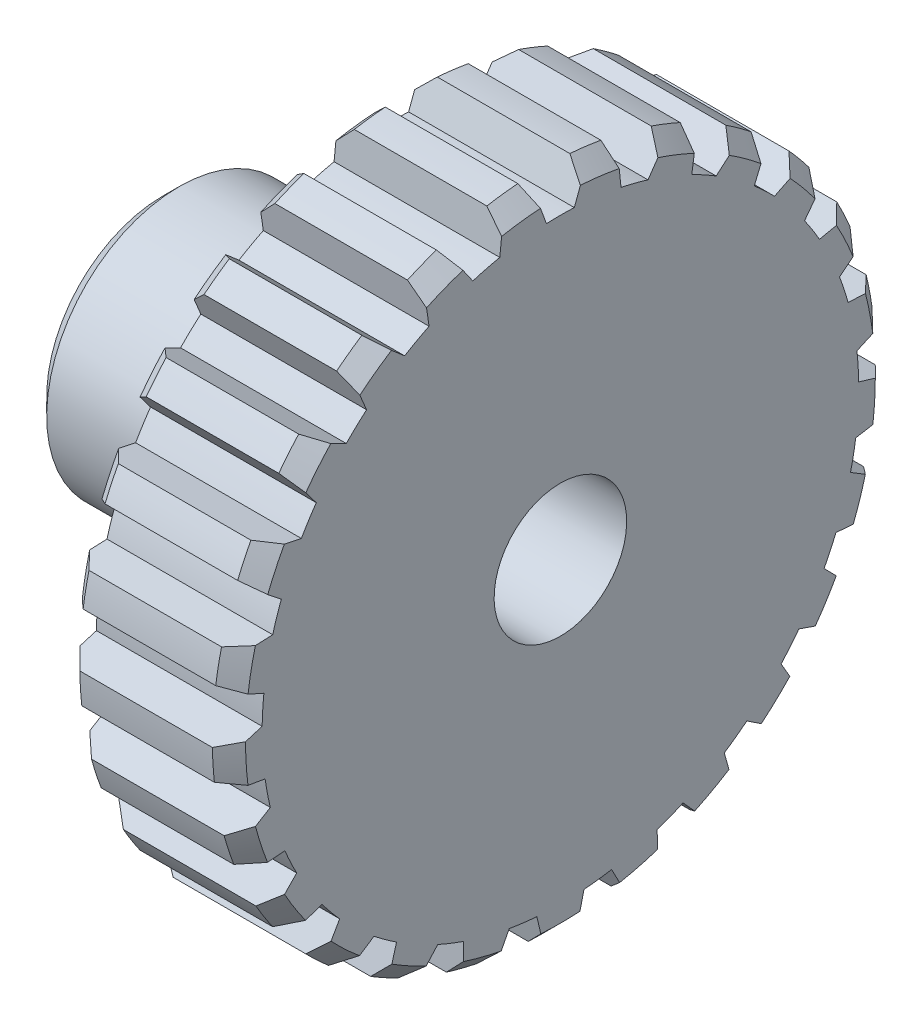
from build123d import *

# Parameters (mm, degrees)
CHAMFER4_SIZE      = 0.5
CUT_EXTRUDE2_DEPTH = 10


with BuildPart() as part:
    # Sketch1 → Revolve1 (revolve)
    with BuildSketch(Plane.XY):
        Polygon((0, 2), (-12, 2), (-12, 4), (-5, 4), (-5, 10), (0, 10), align=None)
    revolve(axis=Axis((0, 0, 0), (-1, 0, 0)))

    # Chamfer4
    chamfer4_edges = [part.edges().sort_by_distance(p)[0] for p in [
        (-12, -4, 0),
        (-5, -10, 0),
        (0, -10, 0),
    ]]
    chamfer(chamfer4_edges, length=CHAMFER4_SIZE)

    # Sketch3 → Cut-Extrude2 (cut)
    with BuildSketch(Plane(origin=(0, 0, 0), x_dir=(0, 0, -1), z_dir=(1, 0, 0))):
        with BuildLine():
            Line((-0.785, 9.969141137), (-0.42, 8.990194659))
            ThreePointArc((-0.42, 8.990194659), (0, 9), (0.42, 8.990194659))
            Line((0.42, 8.990194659), (0.785, 9.969141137))
            Line((0.785, 9.969141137), (0.785, 10.77942288))
            ThreePointArc((0.785, 10.77942288), (0, 10.807968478), (-0.785, 10.77942288))
            Line((-0.785, 10.77942288), (-0.785, 9.969141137))
        make_face()
        with BuildLine():
            Line((1.920395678, 10.63598905), (1.718886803, 9.851163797))
            Line((1.718886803, 9.851163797), (1.828965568, 8.812200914))
            ThreePointArc((1.828965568, 8.812200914), (2.238208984, 8.71724845), (2.642575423, 8.603301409))
            Line((2.642575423, 8.603301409), (3.239562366, 9.460720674))
            Line((3.239562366, 9.460720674), (3.441071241, 10.245545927))
            ThreePointArc((3.441071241, 10.245545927), (2.687832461, 10.468416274), (1.920395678, 10.63598905))
        make_face()
        with BuildLine():
            Line((4.505125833, 9.824256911), (4.114769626, 9.114201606))
            Line((4.114769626, 9.114201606), (3.963010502, 8.080504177))
            ThreePointArc((3.963010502, 8.080504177), (4.335783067, 7.88676012), (4.699108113, 7.675831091))
            Line((4.699108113, 7.675831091), (5.490571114, 8.357848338))
            Line((5.490571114, 8.357848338), (5.880927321, 9.067903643))
            ThreePointArc((5.880927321, 9.067903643), (5.206778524, 9.471094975), (4.505125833, 9.824256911))
        make_face()
        with BuildLine():
            Line((6.806782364, 8.39523058), (6.252106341, 7.804560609))
            Line((6.252106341, 7.804560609), (5.848044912, 6.841079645))
            ThreePointArc((5.848044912, 6.841079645), (6.160923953, 6.560717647), (6.460378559, 6.266060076))
            Line((6.460378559, 6.266060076), (7.396587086, 6.729821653))
            Line((7.396587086, 6.729821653), (7.951263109, 7.320491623))
            ThreePointArc((7.951263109, 7.320491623), (7.398563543, 7.878669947), (6.806782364, 8.39523058))
        make_face()
        with BuildLine():
            Line((8.680743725, 6.438701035), (7.996600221, 6.004530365))
            Line((7.996600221, 6.004530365), (7.365625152, 5.171804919))
            ThreePointArc((7.365625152, 5.171804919), (7.59895133, 4.822441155), (7.81571966, 4.462569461))
            Line((7.81571966, 4.462569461), (8.837848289, 4.678935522))
            Line((8.837848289, 4.678935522), (9.521991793, 5.113106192))
            ThreePointArc((9.521991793, 5.113106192), (9.125469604, 5.79119911), (8.680743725, 6.438701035))
        make_face()
        with BuildLine():
            Line((10.009262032, 4.077604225), (9.238638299, 3.827213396))
            Line((9.238638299, 3.827213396), (8.420396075, 3.177566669))
            ThreePointArc((8.420396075, 3.177566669), (8.559508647, 2.781152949), (8.67997035, 2.378679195))
            Line((8.67997035, 2.378679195), (9.72379498, 2.334054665))
            Line((9.72379498, 2.334054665), (10.494418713, 2.584445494))
            ThreePointArc((10.494418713, 2.584445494), (10.278988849, 3.339845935), (10.009262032, 4.077604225))
        make_face()
        with BuildLine():
            Line((10.708861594, 1.460296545), (9.900178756, 1.409418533))
            Line((9.900178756, 1.409418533), (8.946082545, 0.983670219))
            ThreePointArc((8.946082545, 0.983670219), (8.982240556, 0.565114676), (8.998826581, 0.145327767))
            Line((8.998826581, 0.145327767), (9.998759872, -0.157483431))
            Line((9.998759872, -0.157483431), (10.807442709, -0.106605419))
            ThreePointArc((10.807442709, -0.106605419), (10.786641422, 0.678637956), (10.708861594, 1.460296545))
        make_face()
        with BuildLine():
            Line((10.735583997, -1.248766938), (9.939654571, -1.09693528))
            Line((9.939654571, -1.09693528), (8.909653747, -1.272033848))
            ThreePointArc((8.909653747, -1.272033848), (8.840585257, -1.686431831), (8.752253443, -2.097155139))
            Line((8.752253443, -2.097155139), (9.645465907, -2.639126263))
            Line((9.645465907, -2.639126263), (10.441395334, -2.790957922))
            ThreePointArc((10.441395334, -2.790957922), (10.616529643, -2.025211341), (10.735583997, -1.248766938))
        make_face()
        with BuildLine():
            Line((10.087750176, -3.879365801), (9.354585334, -3.534364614))
            Line((9.354585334, -3.534364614), (8.313398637, -3.447811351))
            ThreePointArc((8.313398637, -3.447811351), (8.143443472, -3.832013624), (7.955744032, -4.207866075))
            Line((7.955744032, -4.207866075), (8.686111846, -4.954943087))
            Line((8.686111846, -4.954943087), (9.419276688, -5.299944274))
            ThreePointArc((9.419276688, -5.299944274), (9.779342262, -4.601809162), (10.087750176, -3.879365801))
        make_face()
        with BuildLine():
            Line((8.806065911, -6.266209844), (8.181733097, -5.749716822))
            Line((8.181733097, -5.749716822), (7.194782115, -5.406950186))
            ThreePointArc((7.194782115, -5.406950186), (6.934619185, -5.736815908), (6.659345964, -6.05418131))
            Line((6.659345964, -6.05418131), (7.180977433, -6.959422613))
            Line((7.180977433, -6.959422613), (7.805310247, -7.475915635))
            ThreePointArc((7.805310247, -7.475915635), (8.32768284, -6.889258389), (8.806065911, -6.266209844))
        make_face()
        with BuildLine():
            Line((6.971064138, -8.259324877), (6.494792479, -7.603793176))
            Line((6.494792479, -7.603793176), (5.624090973, -7.026350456))
            ThreePointArc((5.624090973, -7.026350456), (5.290067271, -7.281152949), (4.944516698, -7.520090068))
            Line((4.944516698, -7.520090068), (5.224635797, -8.526616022))
            Line((5.224635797, -8.526616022), (5.700907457, -9.182147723))
            ThreePointArc((5.700907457, -9.182147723), (6.352764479, -8.743830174), (6.971064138, -8.259324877))
        make_face()
        with BuildLine():
            Line((4.698044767, -9.733476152), (4.399760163, -8.980095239))
            Line((4.399760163, -8.980095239), (3.700017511, -8.204259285))
            ThreePointArc((3.700017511, -8.204259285), (3.313120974, -8.367988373), (2.919005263, -8.513483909))
            Line((2.919005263, -8.513483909), (2.94001108, -9.558050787))
            Line((2.94001108, -9.558050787), (3.238295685, -10.311431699))
            ThreePointArc((3.238295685, -10.311431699), (3.978678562, -10.048994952), (4.698044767, -9.733476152))
        make_face()
        with BuildLine():
            Line((2.129829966, -10.596037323), (2.028274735, -9.792144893))
            Line((2.028274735, -9.792144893), (1.543458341, -8.86666433))
            ThreePointArc((1.543458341, -8.86666433), (1.127999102, -8.929032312), (0.710081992, -8.971944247))
            Line((0.710081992, -8.971944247), (0.470654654, -9.988918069))
            Line((0.470654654, -9.988918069), (0.572209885, -10.7928105))
            ThreePointArc((0.572209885, -10.7928105), (1.354597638, -10.722744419), (2.129829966, -10.596037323))
        make_face()
        with BuildLine():
            Line((-0.572209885, -10.7928105), (-0.470654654, -9.988918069))
            Line((-0.470654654, -9.988918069), (-0.710081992, -8.971944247))
            ThreePointArc((-0.710081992, -8.971944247), (-1.127999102, -8.929032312), (-1.543458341, -8.86666433))
            Line((-1.543458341, -8.86666433), (-2.028274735, -9.792144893))
            Line((-2.028274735, -9.792144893), (-2.129829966, -10.596037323))
            ThreePointArc((-2.129829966, -10.596037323), (-1.354597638, -10.722744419), (-0.572209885, -10.7928105))
        make_face()
        with BuildLine():
            Line((-3.238295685, -10.311431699), (-2.94001108, -9.558050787))
            Line((-2.94001108, -9.558050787), (-2.919005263, -8.513483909))
            ThreePointArc((-2.919005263, -8.513483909), (-3.313120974, -8.367988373), (-3.700017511, -8.204259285))
            Line((-3.700017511, -8.204259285), (-4.399760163, -8.980095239))
            Line((-4.399760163, -8.980095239), (-4.698044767, -9.733476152))
            ThreePointArc((-4.698044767, -9.733476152), (-3.978678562, -10.048994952), (-3.238295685, -10.311431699))
        make_face()
        with BuildLine():
            Line((-5.700907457, -9.182147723), (-5.224635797, -8.526616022))
            Line((-5.224635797, -8.526616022), (-4.944516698, -7.520090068))
            ThreePointArc((-4.944516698, -7.520090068), (-5.290067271, -7.281152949), (-5.624090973, -7.026350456))
            Line((-5.624090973, -7.026350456), (-6.494792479, -7.603793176))
            Line((-6.494792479, -7.603793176), (-6.971064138, -8.259324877))
            ThreePointArc((-6.971064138, -8.259324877), (-6.352764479, -8.743830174), (-5.700907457, -9.182147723))
        make_face()
        with BuildLine():
            Line((-7.805310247, -7.475915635), (-7.180977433, -6.959422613))
            Line((-7.180977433, -6.959422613), (-6.659345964, -6.05418131))
            ThreePointArc((-6.659345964, -6.05418131), (-6.934619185, -5.736815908), (-7.194782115, -5.406950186))
            Line((-7.194782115, -5.406950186), (-8.181733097, -5.749716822))
            Line((-8.181733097, -5.749716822), (-8.806065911, -6.266209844))
            ThreePointArc((-8.806065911, -6.266209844), (-8.32768284, -6.889258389), (-7.805310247, -7.475915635))
        make_face()
        with BuildLine():
            Line((-9.419276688, -5.299944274), (-8.686111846, -4.954943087))
            Line((-8.686111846, -4.954943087), (-7.955744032, -4.207866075))
            ThreePointArc((-7.955744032, -4.207866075), (-8.143443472, -3.832013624), (-8.313398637, -3.447811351))
            Line((-8.313398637, -3.447811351), (-9.354585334, -3.534364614))
            Line((-9.354585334, -3.534364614), (-10.087750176, -3.879365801))
            ThreePointArc((-10.087750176, -3.879365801), (-9.779342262, -4.601809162), (-9.419276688, -5.299944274))
        make_face()
        with BuildLine():
            Line((-10.441395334, -2.790957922), (-9.645465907, -2.639126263))
            Line((-9.645465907, -2.639126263), (-8.752253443, -2.097155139))
            ThreePointArc((-8.752253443, -2.097155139), (-8.840585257, -1.686431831), (-8.909653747, -1.272033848))
            Line((-8.909653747, -1.272033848), (-9.939654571, -1.09693528))
            Line((-9.939654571, -1.09693528), (-10.735583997, -1.248766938))
            ThreePointArc((-10.735583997, -1.248766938), (-10.616529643, -2.025211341), (-10.441395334, -2.790957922))
        make_face()
        with BuildLine():
            Line((-10.807442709, -0.106605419), (-9.998759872, -0.157483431))
            Line((-9.998759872, -0.157483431), (-8.998826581, 0.145327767))
            ThreePointArc((-8.998826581, 0.145327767), (-8.982240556, 0.565114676), (-8.946082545, 0.983670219))
            Line((-8.946082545, 0.983670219), (-9.900178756, 1.409418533))
            Line((-9.900178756, 1.409418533), (-10.708861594, 1.460296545))
            ThreePointArc((-10.708861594, 1.460296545), (-10.786641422, 0.678637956), (-10.807442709, -0.106605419))
        make_face()
        with BuildLine():
            Line((-10.494418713, 2.584445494), (-9.72379498, 2.334054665))
            Line((-9.72379498, 2.334054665), (-8.67997035, 2.378679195))
            ThreePointArc((-8.67997035, 2.378679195), (-8.559508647, 2.781152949), (-8.420396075, 3.177566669))
            Line((-8.420396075, 3.177566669), (-9.238638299, 3.827213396))
            Line((-9.238638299, 3.827213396), (-10.009262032, 4.077604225))
            ThreePointArc((-10.009262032, 4.077604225), (-10.278988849, 3.339845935), (-10.494418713, 2.584445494))
        make_face()
        with BuildLine():
            Line((-9.521991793, 5.113106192), (-8.837848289, 4.678935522))
            Line((-8.837848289, 4.678935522), (-7.81571966, 4.462569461))
            ThreePointArc((-7.81571966, 4.462569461), (-7.59895133, 4.822441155), (-7.365625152, 5.171804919))
            Line((-7.365625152, 5.171804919), (-7.996600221, 6.004530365))
            Line((-7.996600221, 6.004530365), (-8.680743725, 6.438701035))
            ThreePointArc((-8.680743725, 6.438701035), (-9.125469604, 5.79119911), (-9.521991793, 5.113106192))
        make_face()
        with BuildLine():
            Line((-7.951263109, 7.320491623), (-7.396587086, 6.729821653))
            Line((-7.396587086, 6.729821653), (-6.460378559, 6.266060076))
            ThreePointArc((-6.460378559, 6.266060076), (-6.160923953, 6.560717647), (-5.848044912, 6.841079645))
            Line((-5.848044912, 6.841079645), (-6.252106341, 7.804560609))
            Line((-6.252106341, 7.804560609), (-6.806782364, 8.39523058))
            ThreePointArc((-6.806782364, 8.39523058), (-7.398563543, 7.878669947), (-7.951263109, 7.320491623))
        make_face()
        with BuildLine():
            Line((-5.880927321, 9.067903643), (-5.490571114, 8.357848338))
            Line((-5.490571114, 8.357848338), (-4.699108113, 7.675831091))
            ThreePointArc((-4.699108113, 7.675831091), (-4.335783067, 7.88676012), (-3.963010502, 8.080504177))
            Line((-3.963010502, 8.080504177), (-4.114769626, 9.114201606))
            Line((-4.114769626, 9.114201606), (-4.505125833, 9.824256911))
            ThreePointArc((-4.505125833, 9.824256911), (-5.206778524, 9.471094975), (-5.880927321, 9.067903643))
        make_face()
        with BuildLine():
            Line((-3.441071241, 10.245545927), (-3.239562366, 9.460720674))
            Line((-3.239562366, 9.460720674), (-2.642575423, 8.603301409))
            ThreePointArc((-2.642575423, 8.603301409), (-2.238208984, 8.71724845), (-1.828965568, 8.812200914))
            Line((-1.828965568, 8.812200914), (-1.718886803, 9.851163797))
            Line((-1.718886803, 9.851163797), (-1.920395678, 10.63598905))
            ThreePointArc((-1.920395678, 10.63598905), (-2.687832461, 10.468416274), (-3.441071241, 10.245545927))
        make_face()
    extrude(amount=-CUT_EXTRUDE2_DEPTH, mode=Mode.SUBTRACT)


solid = part.part
